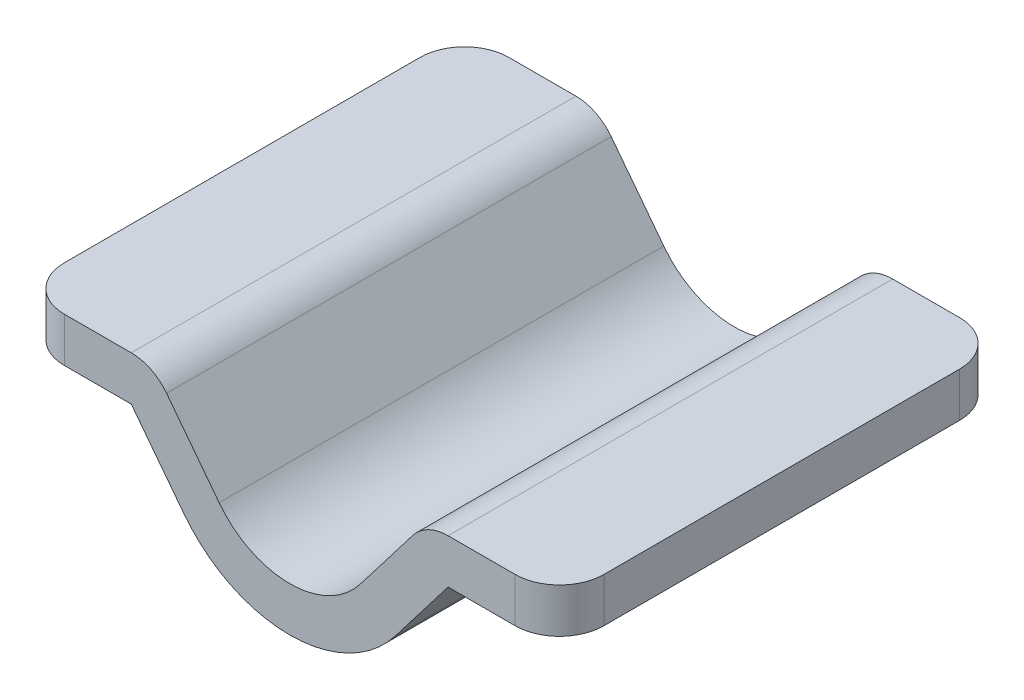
from build123d import *

# Parameters (mm, degrees)
EXTRUDE_THIN1_DEPTH = 127
FILLET1_R           = 25.4


with BuildPart() as part:
    # Sketch1 → Extrude-Thin1 (new, symmetric)
    with BuildSketch(Plane.XY):
        with BuildLine():
            Line((154.160421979, 101.6), (90.4863158, 101.6))
            ThreePointArc((90.4863158, 101.6), (79.252183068, 98.980567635), (70.335140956, 91.662540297))
            Line((70.335140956, 91.662540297), (40.302349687, 52.523044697))
            ThreePointArc((40.302349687, 52.523044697), (0, 32.648125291), (-40.302349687, 52.523044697))
            Line((-40.302349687, 52.523044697), (-70.335140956, 91.662540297))
            ThreePointArc((-70.335140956, 91.662540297), (-79.252183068, 98.980567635), (-90.4863158, 101.6))
            Line((-90.4863158, 101.6), (-154.160421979, 101.6))
            Line((-154.160421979, 101.6), (-154.160421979, 76.2))
            Line((-154.160421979, 76.2), (-90.4863158, 76.2))
            Line((-90.4863158, 76.2), (-60.45352453, 37.0605044))
            ThreePointArc((-60.45352453, 37.0605044), (0, 7.248125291), (60.45352453, 37.0605044))
            Line((60.45352453, 37.0605044), (90.4863158, 76.2))
            Line((90.4863158, 76.2), (154.160421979, 76.2))
            Line((154.160421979, 76.2), (154.160421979, 101.6))
        make_face()
    extrude(amount=EXTRUDE_THIN1_DEPTH, both=True)

    # Fillet1
    fillet1_edges = [part.edges().sort_by_distance(p)[0] for p in [
        (-154.160421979, 88.9, -127),
        (154.160421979, 88.9, -127),
        (-154.160421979, 88.9, 127),
        (154.160421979, 88.9, 127),
    ]]
    fillet(fillet1_edges, radius=FILLET1_R)


solid = part.part
